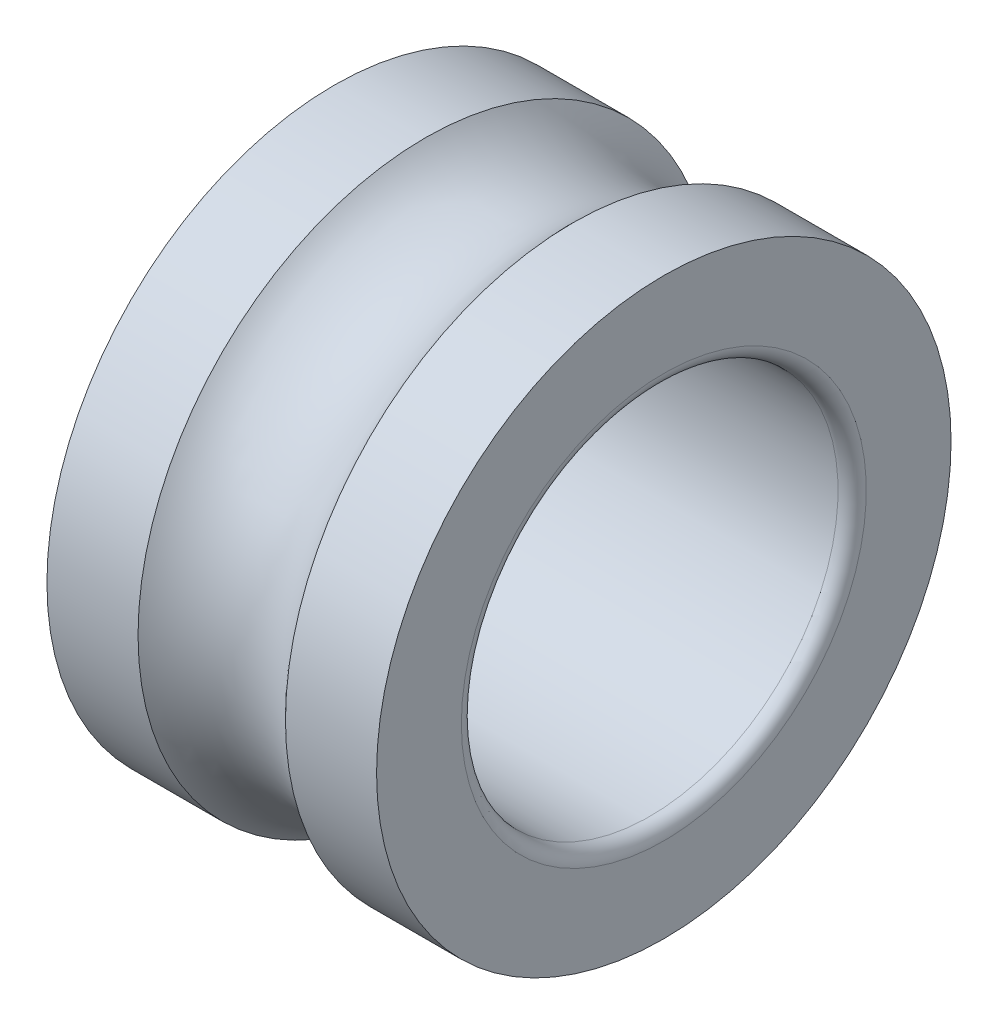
from build123d import *


with BuildPart() as part:
    # Esquisse1 → Base-R_volution (revolve)
    with BuildSketch(Plane(origin=(0, 0, 0), x_dir=(1, 0, 0), z_dir=(0, 1, 0)), mode=Mode.PRIVATE) as base_r_volution_sk:
        with BuildLine():
            Line((0, 6.1), (0, 4.3))
            ThreePointArc((0, 4.3), (0.087867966, 4.087867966), (0.3, 4))
            Line((0.3, 4), (6.7, 4))
            ThreePointArc((6.7, 4), (6.912132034, 4.087867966), (7, 4.3))
            Line((7, 4.3), (7, 6.1))
            Line((7, 6.1), (5.065247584, 6.1))
            ThreePointArc((5.065247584, 6.1), (3.5, 5.4), (1.934752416, 6.1))
            Line((1.934752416, 6.1), (0, 6.1))
        make_face()
    revolve(base_r_volution_sk.sketch.rotate(Axis((0, 0, 0), (1, 0, 0)), 180), axis=Axis((0, 0, 0), (1, 0, 0)))


solid = part.part
